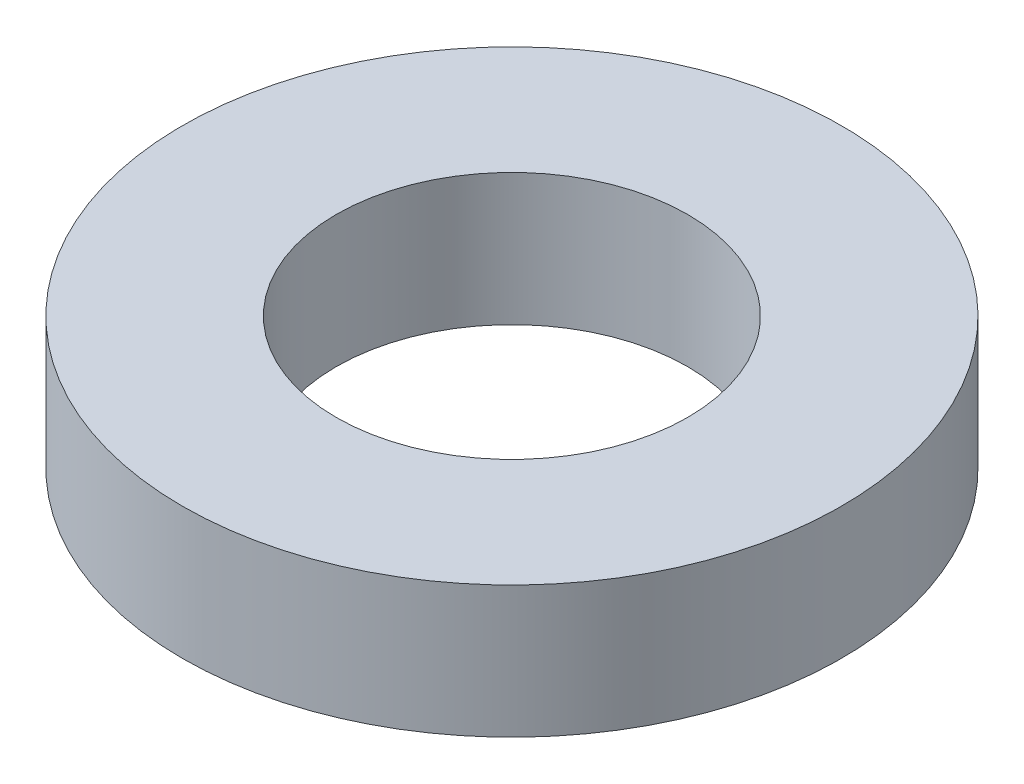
ISO-10303-21;
HEADER;
FILE_DESCRIPTION(('STEP AP214'),'2;1');
FILE_NAME('part.step','',(''),(''),'','','');
FILE_SCHEMA(('AUTOMOTIVE_DESIGN { 1 0 10303 214 1 1 1 1 }'));
ENDSEC;
DATA;
#1=APPLICATION_CONTEXT('core data for automotive mechanical design processes');
#2=APPLICATION_PROTOCOL_DEFINITION('international standard','automotive_design',2000,#1);
#3=PRODUCT_CONTEXT('',#1,'mechanical');
#4=PRODUCT('Part','Part','',(#3));
#5=PRODUCT_RELATED_PRODUCT_CATEGORY('part','',(#4));
#6=PRODUCT_DEFINITION_FORMATION('','',#4);
#7=PRODUCT_DEFINITION_CONTEXT('part definition',#1,'design');
#8=PRODUCT_DEFINITION('design','',#6,#7);
#9=PRODUCT_DEFINITION_SHAPE('','',#8);
#10=(LENGTH_UNIT() NAMED_UNIT(*) SI_UNIT(.MILLI.,.METRE.));
#11=(NAMED_UNIT(*) PLANE_ANGLE_UNIT() SI_UNIT($,.RADIAN.));
#12=(NAMED_UNIT(*) SI_UNIT($,.STERADIAN.) SOLID_ANGLE_UNIT());
#13=UNCERTAINTY_MEASURE_WITH_UNIT(LENGTH_MEASURE(1.E-05),#10,'distance_accuracy_value','');
#14=(GEOMETRIC_REPRESENTATION_CONTEXT(3) GLOBAL_UNCERTAINTY_ASSIGNED_CONTEXT((#13)) GLOBAL_UNIT_ASSIGNED_CONTEXT((#10,
#11,#12)) REPRESENTATION_CONTEXT('',''));
#15=CARTESIAN_POINT('',(0.,0.,0.));
#16=DIRECTION('',(0.,0.,1.));
#17=DIRECTION('',(1.,0.,0.));
#18=AXIS2_PLACEMENT_3D('',#15,#16,#17);
#19=CARTESIAN_POINT('',(0.,1.2,0.));
#20=DIRECTION('',(0.,-1.,0.));
#21=DIRECTION('',(0.,0.,-1.));
#22=AXIS2_PLACEMENT_3D('',#19,#20,#21);
#23=CYLINDRICAL_SURFACE('',#22,1.6);
#24=CARTESIAN_POINT('',(0.,1.2,0.));
#25=DIRECTION('',(0.,-1.,0.));
#26=DIRECTION('',(0.,0.,-1.));
#27=AXIS2_PLACEMENT_3D('',#24,#25,#26);
#28=CIRCLE('',#27,1.6);
#29=CARTESIAN_POINT('',(0.,1.2,-1.6));
#30=VERTEX_POINT('',#29);
#31=EDGE_CURVE('E18',#30,#30,#28,.T.);
#32=ORIENTED_EDGE('',*,*,#31,.F.);
#33=EDGE_LOOP('',(#32));
#34=FACE_BOUND('',#33,.T.);
#35=CARTESIAN_POINT('',(0.,0.,0.));
#36=DIRECTION('',(0.,-1.,0.));
#37=DIRECTION('',(0.,0.,-1.));
#38=AXIS2_PLACEMENT_3D('',#35,#36,#37);
#39=CIRCLE('',#38,1.6);
#40=CARTESIAN_POINT('',(0.,0.,-1.6));
#41=VERTEX_POINT('',#40);
#42=EDGE_CURVE('E27',#41,#41,#39,.F.);
#43=ORIENTED_EDGE('',*,*,#42,.F.);
#44=EDGE_LOOP('',(#43));
#45=FACE_BOUND('',#44,.T.);
#46=ADVANCED_FACE('F15',(#34,#45),#23,.F.);
#47=CARTESIAN_POINT('',(0.,1.2,0.));
#48=DIRECTION('',(0.,1.,0.));
#49=DIRECTION('',(0.,0.,1.));
#50=AXIS2_PLACEMENT_3D('',#47,#48,#49);
#51=PLANE('',#50);
#52=CARTESIAN_POINT('',(0.,1.2,0.));
#53=DIRECTION('',(0.,1.,0.));
#54=DIRECTION('',(0.,0.,1.));
#55=AXIS2_PLACEMENT_3D('',#52,#53,#54);
#56=CIRCLE('',#55,3.);
#57=CARTESIAN_POINT('',(0.,1.2,3.));
#58=VERTEX_POINT('',#57);
#59=EDGE_CURVE('E22',#58,#58,#56,.F.);
#60=ORIENTED_EDGE('',*,*,#59,.F.);
#61=EDGE_LOOP('',(#60));
#62=FACE_BOUND('',#61,.T.);
#63=ORIENTED_EDGE('',*,*,#31,.T.);
#64=EDGE_LOOP('',(#63));
#65=FACE_BOUND('',#64,.T.);
#66=ADVANCED_FACE('F35',(#62,#65),#51,.T.);
#67=CARTESIAN_POINT('',(0.,0.,0.));
#68=DIRECTION('',(0.,-1.,0.));
#69=DIRECTION('',(0.,0.,-1.));
#70=AXIS2_PLACEMENT_3D('',#67,#68,#69);
#71=PLANE('',#70);
#72=CARTESIAN_POINT('',(0.,0.,0.));
#73=DIRECTION('',(0.,1.,0.));
#74=DIRECTION('',(0.,0.,1.));
#75=AXIS2_PLACEMENT_3D('',#72,#73,#74);
#76=CIRCLE('',#75,3.);
#77=CARTESIAN_POINT('',(0.,0.,3.));
#78=VERTEX_POINT('',#77);
#79=EDGE_CURVE('E10',#78,#78,#76,.T.);
#80=ORIENTED_EDGE('',*,*,#79,.F.);
#81=EDGE_LOOP('',(#80));
#82=FACE_BOUND('',#81,.T.);
#83=ORIENTED_EDGE('',*,*,#42,.T.);
#84=EDGE_LOOP('',(#83));
#85=FACE_BOUND('',#84,.T.);
#86=ADVANCED_FACE('F43',(#82,#85),#71,.T.);
#87=CARTESIAN_POINT('',(0.,0.,0.));
#88=DIRECTION('',(0.,1.,0.));
#89=DIRECTION('',(0.,0.,1.));
#90=AXIS2_PLACEMENT_3D('',#87,#88,#89);
#91=CYLINDRICAL_SURFACE('',#90,3.);
#92=ORIENTED_EDGE('',*,*,#79,.T.);
#93=EDGE_LOOP('',(#92));
#94=FACE_BOUND('',#93,.T.);
#95=ORIENTED_EDGE('',*,*,#59,.T.);
#96=EDGE_LOOP('',(#95));
#97=FACE_BOUND('',#96,.T.);
#98=ADVANCED_FACE('F45',(#94,#97),#91,.T.);
#99=CLOSED_SHELL('',(#46,#66,#86,#98));
#100=MANIFOLD_SOLID_BREP('B1',#99);
#101=ADVANCED_BREP_SHAPE_REPRESENTATION('',(#18,#100),#14);
#102=SHAPE_DEFINITION_REPRESENTATION(#9,#101);
ENDSEC;
END-ISO-10303-21;
